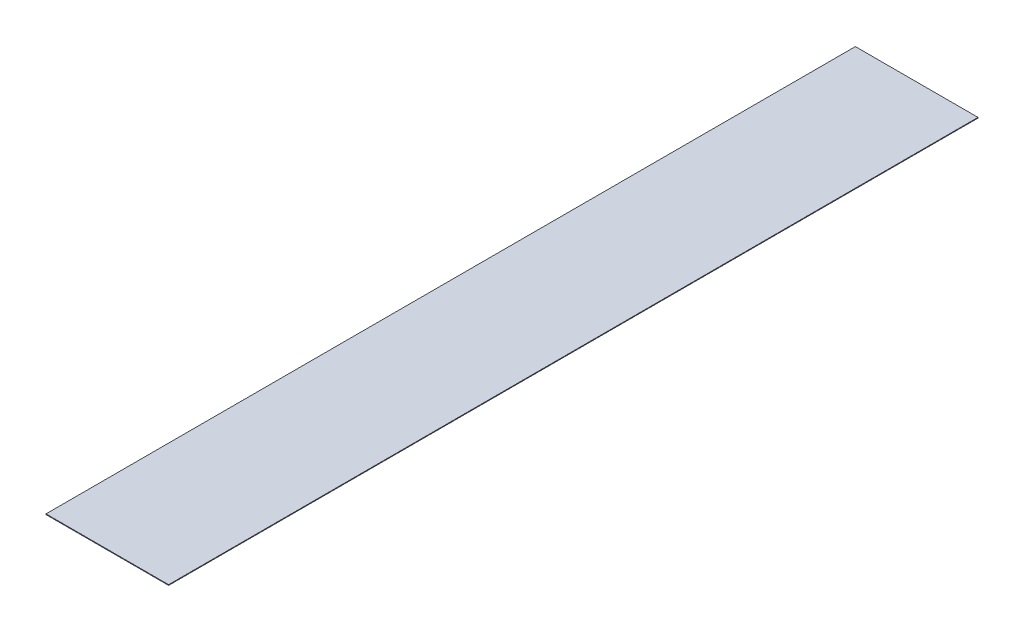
from build123d import *

# Parameters (mm, degrees)
SKETCH1_W           = 47.625
SKETCH1_H           = 314.325
BOSS_EXTRUDE1_DEPTH = 0.254


with BuildPart() as part:
    # Sketch1 → Boss-Extrude1 (new body)
    with BuildSketch(Plane(origin=(0, 0, 0), x_dir=(1, 0, 0), z_dir=(0, 1, 0))):
        with Locations((42.8625, 80.9625)):
            Rectangle(SKETCH1_W, SKETCH1_H)
    extrude(amount=BOSS_EXTRUDE1_DEPTH)


solid = part.part
